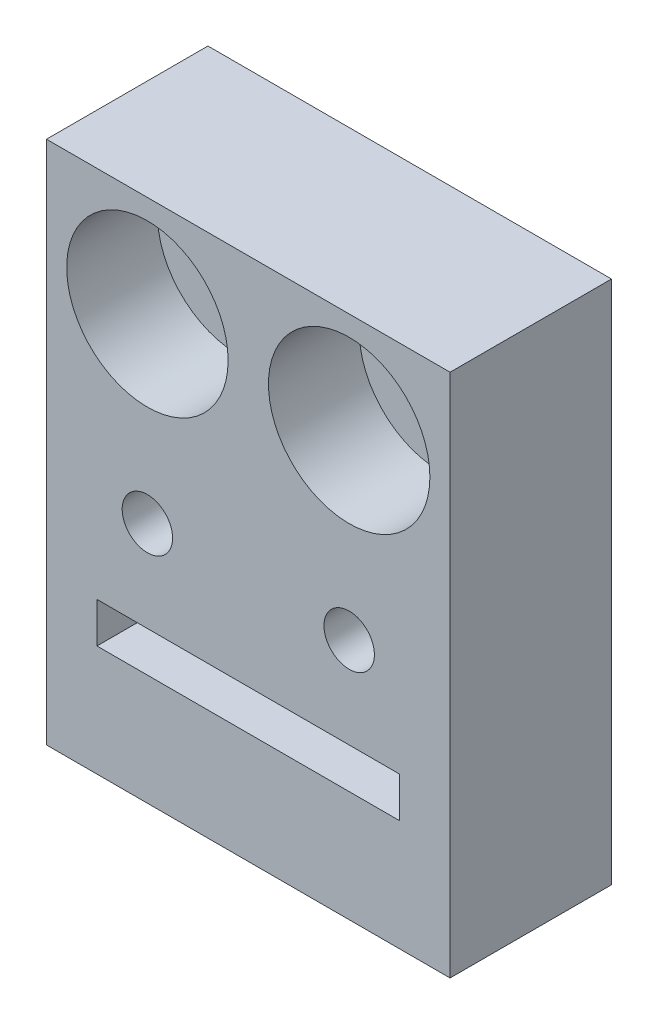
ISO-10303-21;
HEADER;
FILE_DESCRIPTION(('STEP AP214'),'2;1');
FILE_NAME('part.step','',(''),(''),'','','');
FILE_SCHEMA(('AUTOMOTIVE_DESIGN { 1 0 10303 214 1 1 1 1 }'));
ENDSEC;
DATA;
#1=APPLICATION_CONTEXT('core data for automotive mechanical design processes');
#2=APPLICATION_PROTOCOL_DEFINITION('international standard','automotive_design',2000,#1);
#3=PRODUCT_CONTEXT('',#1,'mechanical');
#4=PRODUCT('Part','Part','',(#3));
#5=PRODUCT_RELATED_PRODUCT_CATEGORY('part','',(#4));
#6=PRODUCT_DEFINITION_FORMATION('','',#4);
#7=PRODUCT_DEFINITION_CONTEXT('part definition',#1,'design');
#8=PRODUCT_DEFINITION('design','',#6,#7);
#9=PRODUCT_DEFINITION_SHAPE('','',#8);
#10=(LENGTH_UNIT() NAMED_UNIT(*) SI_UNIT(.MILLI.,.METRE.));
#11=(NAMED_UNIT(*) PLANE_ANGLE_UNIT() SI_UNIT($,.RADIAN.));
#12=(NAMED_UNIT(*) SI_UNIT($,.STERADIAN.) SOLID_ANGLE_UNIT());
#13=UNCERTAINTY_MEASURE_WITH_UNIT(LENGTH_MEASURE(1.E-05),#10,'distance_accuracy_value','');
#14=(GEOMETRIC_REPRESENTATION_CONTEXT(3) GLOBAL_UNCERTAINTY_ASSIGNED_CONTEXT((#13)) GLOBAL_UNIT_ASSIGNED_CONTEXT((#10,
#11,#12)) REPRESENTATION_CONTEXT('',''));
#15=CARTESIAN_POINT('',(0.,0.,0.));
#16=DIRECTION('',(0.,0.,1.));
#17=DIRECTION('',(1.,0.,0.));
#18=AXIS2_PLACEMENT_3D('',#15,#16,#17);
#19=CARTESIAN_POINT('',(15.,-5.,8.));
#20=DIRECTION('',(0.,0.,-1.));
#21=DIRECTION('',(-1.,0.,0.));
#22=AXIS2_PLACEMENT_3D('',#19,#20,#21);
#23=CYLINDRICAL_SURFACE('',#22,2.25);
#24=CARTESIAN_POINT('',(15.,-5.,0.));
#25=DIRECTION('',(0.,0.,1.));
#26=DIRECTION('',(1.,0.,0.));
#27=AXIS2_PLACEMENT_3D('',#24,#25,#26);
#28=CIRCLE('',#27,2.25);
#29=CARTESIAN_POINT('',(17.25,-5.,0.));
#30=VERTEX_POINT('',#29);
#31=EDGE_CURVE('E115',#30,#30,#28,.T.);
#32=ORIENTED_EDGE('',*,*,#31,.F.);
#33=EDGE_LOOP('',(#32));
#34=FACE_BOUND('',#33,.T.);
#35=CARTESIAN_POINT('',(15.,-5.,3.5));
#36=DIRECTION('',(0.,0.,1.));
#37=DIRECTION('',(1.,0.,0.));
#38=AXIS2_PLACEMENT_3D('',#35,#36,#37);
#39=CIRCLE('',#38,2.25);
#40=CARTESIAN_POINT('',(17.25,-5.,3.5));
#41=VERTEX_POINT('',#40);
#42=EDGE_CURVE('E36',#41,#41,#39,.T.);
#43=ORIENTED_EDGE('',*,*,#42,.T.);
#44=EDGE_LOOP('',(#43));
#45=FACE_BOUND('',#44,.T.);
#46=ADVANCED_FACE('F32',(#34,#45),#23,.F.);
#47=CARTESIAN_POINT('',(5.,-5.,8.));
#48=DIRECTION('',(0.,0.,-1.));
#49=DIRECTION('',(-1.,0.,0.));
#50=AXIS2_PLACEMENT_3D('',#47,#48,#49);
#51=CYLINDRICAL_SURFACE('',#50,2.25);
#52=CARTESIAN_POINT('',(5.,-5.,0.));
#53=DIRECTION('',(0.,0.,1.));
#54=DIRECTION('',(1.,0.,0.));
#55=AXIS2_PLACEMENT_3D('',#52,#53,#54);
#56=CIRCLE('',#55,2.25);
#57=CARTESIAN_POINT('',(7.25,-5.,0.));
#58=VERTEX_POINT('',#57);
#59=EDGE_CURVE('E141',#58,#58,#56,.T.);
#60=ORIENTED_EDGE('',*,*,#59,.F.);
#61=EDGE_LOOP('',(#60));
#62=FACE_BOUND('',#61,.T.);
#63=CARTESIAN_POINT('',(5.,-5.,3.5));
#64=DIRECTION('',(0.,0.,1.));
#65=DIRECTION('',(1.,0.,0.));
#66=AXIS2_PLACEMENT_3D('',#63,#64,#65);
#67=CIRCLE('',#66,2.25);
#68=CARTESIAN_POINT('',(7.25,-5.,3.5));
#69=VERTEX_POINT('',#68);
#70=EDGE_CURVE('E169',#69,#69,#67,.T.);
#71=ORIENTED_EDGE('',*,*,#70,.T.);
#72=EDGE_LOOP('',(#71));
#73=FACE_BOUND('',#72,.T.);
#74=ADVANCED_FACE('F215',(#62,#73),#51,.F.);
#75=CARTESIAN_POINT('',(20.,-26.,8.));
#76=DIRECTION('',(0.,0.,1.));
#77=DIRECTION('',(1.,0.,0.));
#78=AXIS2_PLACEMENT_3D('',#75,#76,#77);
#79=PLANE('',#78);
#80=CARTESIAN_POINT('',(15.,-5.,8.));
#81=DIRECTION('',(0.,0.,1.));
#82=DIRECTION('',(1.,0.,0.));
#83=AXIS2_PLACEMENT_3D('',#80,#81,#82);
#84=CIRCLE('',#83,4.);
#85=CARTESIAN_POINT('',(19.,-5.,8.));
#86=VERTEX_POINT('',#85);
#87=EDGE_CURVE('E186',#86,#86,#84,.T.);
#88=ORIENTED_EDGE('',*,*,#87,.F.);
#89=EDGE_LOOP('',(#88));
#90=FACE_BOUND('',#89,.T.);
#91=CARTESIAN_POINT('',(5.,-5.,8.));
#92=DIRECTION('',(0.,0.,1.));
#93=DIRECTION('',(1.,0.,0.));
#94=AXIS2_PLACEMENT_3D('',#91,#92,#93);
#95=CIRCLE('',#94,4.);
#96=CARTESIAN_POINT('',(9.,-5.,8.));
#97=VERTEX_POINT('',#96);
#98=EDGE_CURVE('E179',#97,#97,#95,.T.);
#99=ORIENTED_EDGE('',*,*,#98,.F.);
#100=EDGE_LOOP('',(#99));
#101=FACE_BOUND('',#100,.T.);
#102=CARTESIAN_POINT('',(5.,-14.,8.));
#103=DIRECTION('',(0.,0.,1.));
#104=DIRECTION('',(1.,0.,0.));
#105=AXIS2_PLACEMENT_3D('',#102,#103,#104);
#106=CIRCLE('',#105,1.25);
#107=CARTESIAN_POINT('',(6.25,-14.,8.));
#108=VERTEX_POINT('',#107);
#109=EDGE_CURVE('E129',#108,#108,#106,.T.);
#110=ORIENTED_EDGE('',*,*,#109,.F.);
#111=EDGE_LOOP('',(#110));
#112=FACE_BOUND('',#111,.T.);
#113=DIRECTION('',(1.,0.,0.));
#114=VECTOR('',#113,1.);
#115=CARTESIAN_POINT('',(0.,-26.,8.));
#116=LINE('',#115,#114);
#117=CARTESIAN_POINT('',(0.,-26.,8.));
#118=VERTEX_POINT('',#117);
#119=CARTESIAN_POINT('',(20.,-26.,8.));
#120=VERTEX_POINT('',#119);
#121=EDGE_CURVE('E145',#118,#120,#116,.T.);
#122=ORIENTED_EDGE('',*,*,#121,.T.);
#123=DIRECTION('',(0.,1.,0.));
#124=VECTOR('',#123,1.);
#125=CARTESIAN_POINT('',(20.,-26.,8.));
#126=LINE('',#125,#124);
#127=CARTESIAN_POINT('',(20.,0.,8.));
#128=VERTEX_POINT('',#127);
#129=EDGE_CURVE('E148',#120,#128,#126,.T.);
#130=ORIENTED_EDGE('',*,*,#129,.T.);
#131=DIRECTION('',(-1.,0.,0.));
#132=VECTOR('',#131,1.);
#133=CARTESIAN_POINT('',(0.,0.,8.));
#134=LINE('',#133,#132);
#135=CARTESIAN_POINT('',(0.,0.,8.));
#136=VERTEX_POINT('',#135);
#137=EDGE_CURVE('E151',#128,#136,#134,.T.);
#138=ORIENTED_EDGE('',*,*,#137,.T.);
#139=DIRECTION('',(0.,-1.,0.));
#140=VECTOR('',#139,1.);
#141=CARTESIAN_POINT('',(0.,-26.,8.));
#142=LINE('',#141,#140);
#143=EDGE_CURVE('E153',#136,#118,#142,.T.);
#144=ORIENTED_EDGE('',*,*,#143,.T.);
#145=EDGE_LOOP('',(#122,#130,#138,#144));
#146=FACE_BOUND('',#145,.T.);
#147=DIRECTION('',(1.,0.,0.));
#148=VECTOR('',#147,1.);
#149=CARTESIAN_POINT('',(2.5,-20.5,8.));
#150=LINE('',#149,#148);
#151=CARTESIAN_POINT('',(2.5,-20.5,8.));
#152=VERTEX_POINT('',#151);
#153=CARTESIAN_POINT('',(17.5,-20.5,8.));
#154=VERTEX_POINT('',#153);
#155=EDGE_CURVE('E107',#152,#154,#150,.T.);
#156=ORIENTED_EDGE('',*,*,#155,.F.);
#157=DIRECTION('',(0.,-1.,0.));
#158=VECTOR('',#157,1.);
#159=CARTESIAN_POINT('',(2.5,-20.5,8.));
#160=LINE('',#159,#158);
#161=CARTESIAN_POINT('',(2.5,-18.5,8.));
#162=VERTEX_POINT('',#161);
#163=EDGE_CURVE('E99',#162,#152,#160,.T.);
#164=ORIENTED_EDGE('',*,*,#163,.F.);
#165=DIRECTION('',(-1.,0.,0.));
#166=VECTOR('',#165,1.);
#167=CARTESIAN_POINT('',(2.5,-18.5,8.));
#168=LINE('',#167,#166);
#169=CARTESIAN_POINT('',(17.5,-18.5,8.));
#170=VERTEX_POINT('',#169);
#171=EDGE_CURVE('E123',#170,#162,#168,.T.);
#172=ORIENTED_EDGE('',*,*,#171,.F.);
#173=DIRECTION('',(0.,1.,0.));
#174=VECTOR('',#173,1.);
#175=CARTESIAN_POINT('',(17.5,-20.5,8.));
#176=LINE('',#175,#174);
#177=EDGE_CURVE('E121',#154,#170,#176,.T.);
#178=ORIENTED_EDGE('',*,*,#177,.F.);
#179=EDGE_LOOP('',(#156,#164,#172,#178));
#180=FACE_BOUND('',#179,.T.);
#181=CARTESIAN_POINT('',(15.,-14.,8.));
#182=DIRECTION('',(0.,0.,1.));
#183=DIRECTION('',(1.,0.,0.));
#184=AXIS2_PLACEMENT_3D('',#181,#182,#183);
#185=CIRCLE('',#184,1.25);
#186=CARTESIAN_POINT('',(16.25,-14.,8.));
#187=VERTEX_POINT('',#186);
#188=EDGE_CURVE('E176',#187,#187,#185,.T.);
#189=ORIENTED_EDGE('',*,*,#188,.F.);
#190=EDGE_LOOP('',(#189));
#191=FACE_BOUND('',#190,.T.);
#192=ADVANCED_FACE('F119',(#90,#101,#112,#146,#180,#191),#79,.T.);
#193=CARTESIAN_POINT('',(20.,-26.,0.));
#194=DIRECTION('',(0.,0.,1.));
#195=DIRECTION('',(1.,0.,0.));
#196=AXIS2_PLACEMENT_3D('',#193,#194,#195);
#197=PLANE('',#196);
#198=CARTESIAN_POINT('',(5.,-14.,0.));
#199=DIRECTION('',(0.,0.,1.));
#200=DIRECTION('',(1.,0.,0.));
#201=AXIS2_PLACEMENT_3D('',#198,#199,#200);
#202=CIRCLE('',#201,1.25);
#203=CARTESIAN_POINT('',(6.25,-14.,0.));
#204=VERTEX_POINT('',#203);
#205=EDGE_CURVE('E190',#204,#204,#202,.T.);
#206=ORIENTED_EDGE('',*,*,#205,.T.);
#207=EDGE_LOOP('',(#206));
#208=FACE_BOUND('',#207,.T.);
#209=ORIENTED_EDGE('',*,*,#31,.T.);
#210=EDGE_LOOP('',(#209));
#211=FACE_BOUND('',#210,.T.);
#212=DIRECTION('',(1.,0.,0.));
#213=VECTOR('',#212,1.);
#214=CARTESIAN_POINT('',(0.,-26.,0.));
#215=LINE('',#214,#213);
#216=CARTESIAN_POINT('',(0.,-26.,0.));
#217=VERTEX_POINT('',#216);
#218=CARTESIAN_POINT('',(20.,-26.,0.));
#219=VERTEX_POINT('',#218);
#220=EDGE_CURVE('E144',#217,#219,#215,.T.);
#221=ORIENTED_EDGE('',*,*,#220,.F.);
#222=DIRECTION('',(0.,-1.,0.));
#223=VECTOR('',#222,1.);
#224=CARTESIAN_POINT('',(0.,-26.,0.));
#225=LINE('',#224,#223);
#226=CARTESIAN_POINT('',(0.,0.,0.));
#227=VERTEX_POINT('',#226);
#228=EDGE_CURVE('E149',#227,#217,#225,.T.);
#229=ORIENTED_EDGE('',*,*,#228,.F.);
#230=DIRECTION('',(-1.,0.,0.));
#231=VECTOR('',#230,1.);
#232=CARTESIAN_POINT('',(0.,0.,0.));
#233=LINE('',#232,#231);
#234=CARTESIAN_POINT('',(20.,0.,0.));
#235=VERTEX_POINT('',#234);
#236=EDGE_CURVE('E160',#235,#227,#233,.T.);
#237=ORIENTED_EDGE('',*,*,#236,.F.);
#238=DIRECTION('',(0.,1.,0.));
#239=VECTOR('',#238,1.);
#240=CARTESIAN_POINT('',(20.,-26.,0.));
#241=LINE('',#240,#239);
#242=EDGE_CURVE('E158',#219,#235,#241,.T.);
#243=ORIENTED_EDGE('',*,*,#242,.F.);
#244=EDGE_LOOP('',(#221,#229,#237,#243));
#245=FACE_BOUND('',#244,.T.);
#246=ORIENTED_EDGE('',*,*,#59,.T.);
#247=EDGE_LOOP('',(#246));
#248=FACE_BOUND('',#247,.T.);
#249=DIRECTION('',(0.,-1.,0.));
#250=VECTOR('',#249,1.);
#251=CARTESIAN_POINT('',(2.5,-20.5,0.));
#252=LINE('',#251,#250);
#253=CARTESIAN_POINT('',(2.5,-18.5,0.));
#254=VERTEX_POINT('',#253);
#255=CARTESIAN_POINT('',(2.5,-20.5,0.));
#256=VERTEX_POINT('',#255);
#257=EDGE_CURVE('E57',#254,#256,#252,.T.);
#258=ORIENTED_EDGE('',*,*,#257,.T.);
#259=DIRECTION('',(1.,0.,0.));
#260=VECTOR('',#259,1.);
#261=CARTESIAN_POINT('',(2.5,-20.5,0.));
#262=LINE('',#261,#260);
#263=CARTESIAN_POINT('',(17.5,-20.5,0.));
#264=VERTEX_POINT('',#263);
#265=EDGE_CURVE('E114',#256,#264,#262,.T.);
#266=ORIENTED_EDGE('',*,*,#265,.T.);
#267=DIRECTION('',(0.,1.,0.));
#268=VECTOR('',#267,1.);
#269=CARTESIAN_POINT('',(17.5,-20.5,0.));
#270=LINE('',#269,#268);
#271=CARTESIAN_POINT('',(17.5,-18.5,0.));
#272=VERTEX_POINT('',#271);
#273=EDGE_CURVE('E131',#264,#272,#270,.T.);
#274=ORIENTED_EDGE('',*,*,#273,.T.);
#275=DIRECTION('',(-1.,0.,0.));
#276=VECTOR('',#275,1.);
#277=CARTESIAN_POINT('',(2.5,-18.5,0.));
#278=LINE('',#277,#276);
#279=EDGE_CURVE('E108',#272,#254,#278,.T.);
#280=ORIENTED_EDGE('',*,*,#279,.T.);
#281=EDGE_LOOP('',(#258,#266,#274,#280));
#282=FACE_BOUND('',#281,.T.);
#283=CARTESIAN_POINT('',(15.,-14.,0.));
#284=DIRECTION('',(0.,0.,1.));
#285=DIRECTION('',(1.,0.,0.));
#286=AXIS2_PLACEMENT_3D('',#283,#284,#285);
#287=CIRCLE('',#286,1.25);
#288=CARTESIAN_POINT('',(16.25,-14.,0.));
#289=VERTEX_POINT('',#288);
#290=EDGE_CURVE('E171',#289,#289,#287,.T.);
#291=ORIENTED_EDGE('',*,*,#290,.T.);
#292=EDGE_LOOP('',(#291));
#293=FACE_BOUND('',#292,.T.);
#294=ADVANCED_FACE('F196',(#208,#211,#245,#248,#282,#293),#197,.F.);
#295=CARTESIAN_POINT('',(0.,-26.,8.));
#296=DIRECTION('',(0.,1.,0.));
#297=DIRECTION('',(0.,0.,1.));
#298=AXIS2_PLACEMENT_3D('',#295,#296,#297);
#299=PLANE('',#298);
#300=ORIENTED_EDGE('',*,*,#220,.T.);
#301=DIRECTION('',(0.,0.,-1.));
#302=VECTOR('',#301,1.);
#303=CARTESIAN_POINT('',(20.,-26.,8.));
#304=LINE('',#303,#302);
#305=EDGE_CURVE('E11',#120,#219,#304,.T.);
#306=ORIENTED_EDGE('',*,*,#305,.F.);
#307=ORIENTED_EDGE('',*,*,#121,.F.);
#308=DIRECTION('',(0.,0.,-1.));
#309=VECTOR('',#308,1.);
#310=CARTESIAN_POINT('',(0.,-26.,8.));
#311=LINE('',#310,#309);
#312=EDGE_CURVE('E155',#118,#217,#311,.T.);
#313=ORIENTED_EDGE('',*,*,#312,.T.);
#314=EDGE_LOOP('',(#300,#306,#307,#313));
#315=FACE_BOUND('',#314,.T.);
#316=ADVANCED_FACE('F34',(#315),#299,.F.);
#317=CARTESIAN_POINT('',(20.,-26.,8.));
#318=DIRECTION('',(-1.,0.,0.));
#319=DIRECTION('',(0.,0.,1.));
#320=AXIS2_PLACEMENT_3D('',#317,#318,#319);
#321=PLANE('',#320);
#322=ORIENTED_EDGE('',*,*,#242,.T.);
#323=DIRECTION('',(0.,0.,-1.));
#324=VECTOR('',#323,1.);
#325=CARTESIAN_POINT('',(20.,0.,8.));
#326=LINE('',#325,#324);
#327=EDGE_CURVE('E41',#128,#235,#326,.T.);
#328=ORIENTED_EDGE('',*,*,#327,.F.);
#329=ORIENTED_EDGE('',*,*,#129,.F.);
#330=ORIENTED_EDGE('',*,*,#305,.T.);
#331=EDGE_LOOP('',(#322,#328,#329,#330));
#332=FACE_BOUND('',#331,.T.);
#333=ADVANCED_FACE('F239',(#332),#321,.F.);
#334=CARTESIAN_POINT('',(0.,0.,8.));
#335=DIRECTION('',(0.,-1.,0.));
#336=DIRECTION('',(0.,0.,-1.));
#337=AXIS2_PLACEMENT_3D('',#334,#335,#336);
#338=PLANE('',#337);
#339=ORIENTED_EDGE('',*,*,#236,.T.);
#340=DIRECTION('',(0.,0.,-1.));
#341=VECTOR('',#340,1.);
#342=CARTESIAN_POINT('',(0.,0.,8.));
#343=LINE('',#342,#341);
#344=EDGE_CURVE('E165',#136,#227,#343,.T.);
#345=ORIENTED_EDGE('',*,*,#344,.F.);
#346=ORIENTED_EDGE('',*,*,#137,.F.);
#347=ORIENTED_EDGE('',*,*,#327,.T.);
#348=EDGE_LOOP('',(#339,#345,#346,#347));
#349=FACE_BOUND('',#348,.T.);
#350=ADVANCED_FACE('F236',(#349),#338,.F.);
#351=CARTESIAN_POINT('',(0.,-26.,8.));
#352=DIRECTION('',(1.,0.,0.));
#353=DIRECTION('',(0.,0.,-1.));
#354=AXIS2_PLACEMENT_3D('',#351,#352,#353);
#355=PLANE('',#354);
#356=ORIENTED_EDGE('',*,*,#228,.T.);
#357=ORIENTED_EDGE('',*,*,#312,.F.);
#358=ORIENTED_EDGE('',*,*,#143,.F.);
#359=ORIENTED_EDGE('',*,*,#344,.T.);
#360=EDGE_LOOP('',(#356,#357,#358,#359));
#361=FACE_BOUND('',#360,.T.);
#362=ADVANCED_FACE('F233',(#361),#355,.F.);
#363=CARTESIAN_POINT('',(2.5,-20.5,8.));
#364=DIRECTION('',(1.,0.,0.));
#365=DIRECTION('',(0.,0.,-1.));
#366=AXIS2_PLACEMENT_3D('',#363,#364,#365);
#367=PLANE('',#366);
#368=ORIENTED_EDGE('',*,*,#257,.F.);
#369=DIRECTION('',(0.,0.,-1.));
#370=VECTOR('',#369,1.);
#371=CARTESIAN_POINT('',(2.5,-18.5,8.));
#372=LINE('',#371,#370);
#373=EDGE_CURVE('E103',#162,#254,#372,.T.);
#374=ORIENTED_EDGE('',*,*,#373,.F.);
#375=ORIENTED_EDGE('',*,*,#163,.T.);
#376=DIRECTION('',(0.,0.,-1.));
#377=VECTOR('',#376,1.);
#378=CARTESIAN_POINT('',(2.5,-20.5,8.));
#379=LINE('',#378,#377);
#380=EDGE_CURVE('E102',#152,#256,#379,.T.);
#381=ORIENTED_EDGE('',*,*,#380,.T.);
#382=EDGE_LOOP('',(#368,#374,#375,#381));
#383=FACE_BOUND('',#382,.T.);
#384=ADVANCED_FACE('F101',(#383),#367,.T.);
#385=CARTESIAN_POINT('',(2.5,-20.5,8.));
#386=DIRECTION('',(0.,1.,0.));
#387=DIRECTION('',(0.,0.,1.));
#388=AXIS2_PLACEMENT_3D('',#385,#386,#387);
#389=PLANE('',#388);
#390=ORIENTED_EDGE('',*,*,#265,.F.);
#391=ORIENTED_EDGE('',*,*,#380,.F.);
#392=ORIENTED_EDGE('',*,*,#155,.T.);
#393=DIRECTION('',(0.,0.,-1.));
#394=VECTOR('',#393,1.);
#395=CARTESIAN_POINT('',(17.5,-20.5,8.));
#396=LINE('',#395,#394);
#397=EDGE_CURVE('E116',#154,#264,#396,.T.);
#398=ORIENTED_EDGE('',*,*,#397,.T.);
#399=EDGE_LOOP('',(#390,#391,#392,#398));
#400=FACE_BOUND('',#399,.T.);
#401=ADVANCED_FACE('F111',(#400),#389,.T.);
#402=CARTESIAN_POINT('',(17.5,-20.5,8.));
#403=DIRECTION('',(-1.,0.,0.));
#404=DIRECTION('',(0.,0.,1.));
#405=AXIS2_PLACEMENT_3D('',#402,#403,#404);
#406=PLANE('',#405);
#407=ORIENTED_EDGE('',*,*,#273,.F.);
#408=ORIENTED_EDGE('',*,*,#397,.F.);
#409=ORIENTED_EDGE('',*,*,#177,.T.);
#410=DIRECTION('',(0.,0.,-1.));
#411=VECTOR('',#410,1.);
#412=CARTESIAN_POINT('',(17.5,-18.5,8.));
#413=LINE('',#412,#411);
#414=EDGE_CURVE('E49',#170,#272,#413,.T.);
#415=ORIENTED_EDGE('',*,*,#414,.T.);
#416=EDGE_LOOP('',(#407,#408,#409,#415));
#417=FACE_BOUND('',#416,.T.);
#418=ADVANCED_FACE('F212',(#417),#406,.T.);
#419=CARTESIAN_POINT('',(2.5,-18.5,8.));
#420=DIRECTION('',(0.,-1.,0.));
#421=DIRECTION('',(0.,0.,-1.));
#422=AXIS2_PLACEMENT_3D('',#419,#420,#421);
#423=PLANE('',#422);
#424=ORIENTED_EDGE('',*,*,#279,.F.);
#425=ORIENTED_EDGE('',*,*,#414,.F.);
#426=ORIENTED_EDGE('',*,*,#171,.T.);
#427=ORIENTED_EDGE('',*,*,#373,.T.);
#428=EDGE_LOOP('',(#424,#425,#426,#427));
#429=FACE_BOUND('',#428,.T.);
#430=ADVANCED_FACE('F202',(#429),#423,.T.);
#431=CARTESIAN_POINT('',(5.,-14.,8.));
#432=DIRECTION('',(0.,0.,-1.));
#433=DIRECTION('',(-1.,0.,0.));
#434=AXIS2_PLACEMENT_3D('',#431,#432,#433);
#435=CYLINDRICAL_SURFACE('',#434,1.25);
#436=ORIENTED_EDGE('',*,*,#109,.T.);
#437=EDGE_LOOP('',(#436));
#438=FACE_BOUND('',#437,.T.);
#439=ORIENTED_EDGE('',*,*,#205,.F.);
#440=EDGE_LOOP('',(#439));
#441=FACE_BOUND('',#440,.T.);
#442=ADVANCED_FACE('F199',(#438,#441),#435,.F.);
#443=CARTESIAN_POINT('',(15.,-14.,8.));
#444=DIRECTION('',(0.,0.,-1.));
#445=DIRECTION('',(-1.,0.,0.));
#446=AXIS2_PLACEMENT_3D('',#443,#444,#445);
#447=CYLINDRICAL_SURFACE('',#446,1.25);
#448=ORIENTED_EDGE('',*,*,#188,.T.);
#449=EDGE_LOOP('',(#448));
#450=FACE_BOUND('',#449,.T.);
#451=ORIENTED_EDGE('',*,*,#290,.F.);
#452=EDGE_LOOP('',(#451));
#453=FACE_BOUND('',#452,.T.);
#454=ADVANCED_FACE('F201',(#450,#453),#447,.F.);
#455=CARTESIAN_POINT('',(5.,-5.,3.5));
#456=DIRECTION('',(0.,0.,1.));
#457=DIRECTION('',(1.,0.,0.));
#458=AXIS2_PLACEMENT_3D('',#455,#456,#457);
#459=CYLINDRICAL_SURFACE('',#458,4.);
#460=CARTESIAN_POINT('',(5.,-5.,3.5));
#461=DIRECTION('',(0.,0.,1.));
#462=DIRECTION('',(1.,0.,0.));
#463=AXIS2_PLACEMENT_3D('',#460,#461,#462);
#464=CIRCLE('',#463,4.);
#465=CARTESIAN_POINT('',(9.,-5.,3.5));
#466=VERTEX_POINT('',#465);
#467=EDGE_CURVE('E172',#466,#466,#464,.T.);
#468=ORIENTED_EDGE('',*,*,#467,.F.);
#469=EDGE_LOOP('',(#468));
#470=FACE_BOUND('',#469,.T.);
#471=ORIENTED_EDGE('',*,*,#98,.T.);
#472=EDGE_LOOP('',(#471));
#473=FACE_BOUND('',#472,.T.);
#474=ADVANCED_FACE('F209',(#470,#473),#459,.F.);
#475=CARTESIAN_POINT('',(5.,-5.,3.5));
#476=DIRECTION('',(0.,0.,1.));
#477=DIRECTION('',(1.,0.,0.));
#478=AXIS2_PLACEMENT_3D('',#475,#476,#477);
#479=PLANE('',#478);
#480=ORIENTED_EDGE('',*,*,#70,.F.);
#481=EDGE_LOOP('',(#480));
#482=FACE_BOUND('',#481,.T.);
#483=ORIENTED_EDGE('',*,*,#467,.T.);
#484=EDGE_LOOP('',(#483));
#485=FACE_BOUND('',#484,.T.);
#486=ADVANCED_FACE('F352',(#482,#485),#479,.T.);
#487=CARTESIAN_POINT('',(15.,-5.,3.5));
#488=DIRECTION('',(0.,0.,1.));
#489=DIRECTION('',(1.,0.,0.));
#490=AXIS2_PLACEMENT_3D('',#487,#488,#489);
#491=CYLINDRICAL_SURFACE('',#490,4.);
#492=CARTESIAN_POINT('',(15.,-5.,3.5));
#493=DIRECTION('',(0.,0.,1.));
#494=DIRECTION('',(1.,0.,0.));
#495=AXIS2_PLACEMENT_3D('',#492,#493,#494);
#496=CIRCLE('',#495,4.);
#497=CARTESIAN_POINT('',(19.,-5.,3.5));
#498=VERTEX_POINT('',#497);
#499=EDGE_CURVE('E391',#498,#498,#496,.T.);
#500=ORIENTED_EDGE('',*,*,#499,.F.);
#501=EDGE_LOOP('',(#500));
#502=FACE_BOUND('',#501,.T.);
#503=ORIENTED_EDGE('',*,*,#87,.T.);
#504=EDGE_LOOP('',(#503));
#505=FACE_BOUND('',#504,.T.);
#506=ADVANCED_FACE('F359',(#502,#505),#491,.F.);
#507=CARTESIAN_POINT('',(15.,-5.,3.5));
#508=DIRECTION('',(0.,0.,1.));
#509=DIRECTION('',(1.,0.,0.));
#510=AXIS2_PLACEMENT_3D('',#507,#508,#509);
#511=PLANE('',#510);
#512=ORIENTED_EDGE('',*,*,#42,.F.);
#513=EDGE_LOOP('',(#512));
#514=FACE_BOUND('',#513,.T.);
#515=ORIENTED_EDGE('',*,*,#499,.T.);
#516=EDGE_LOOP('',(#515));
#517=FACE_BOUND('',#516,.T.);
#518=ADVANCED_FACE('F367',(#514,#517),#511,.T.);
#519=CLOSED_SHELL('',(#46,#74,#192,#294,#316,#333,#350,#362,#384,#401,#418,#430,#442,#454,#474,
#486,#506,#518));
#520=MANIFOLD_SOLID_BREP('B2',#519);
#521=ADVANCED_BREP_SHAPE_REPRESENTATION('',(#18,#520),#14);
#522=SHAPE_DEFINITION_REPRESENTATION(#9,#521);
ENDSEC;
END-ISO-10303-21;
